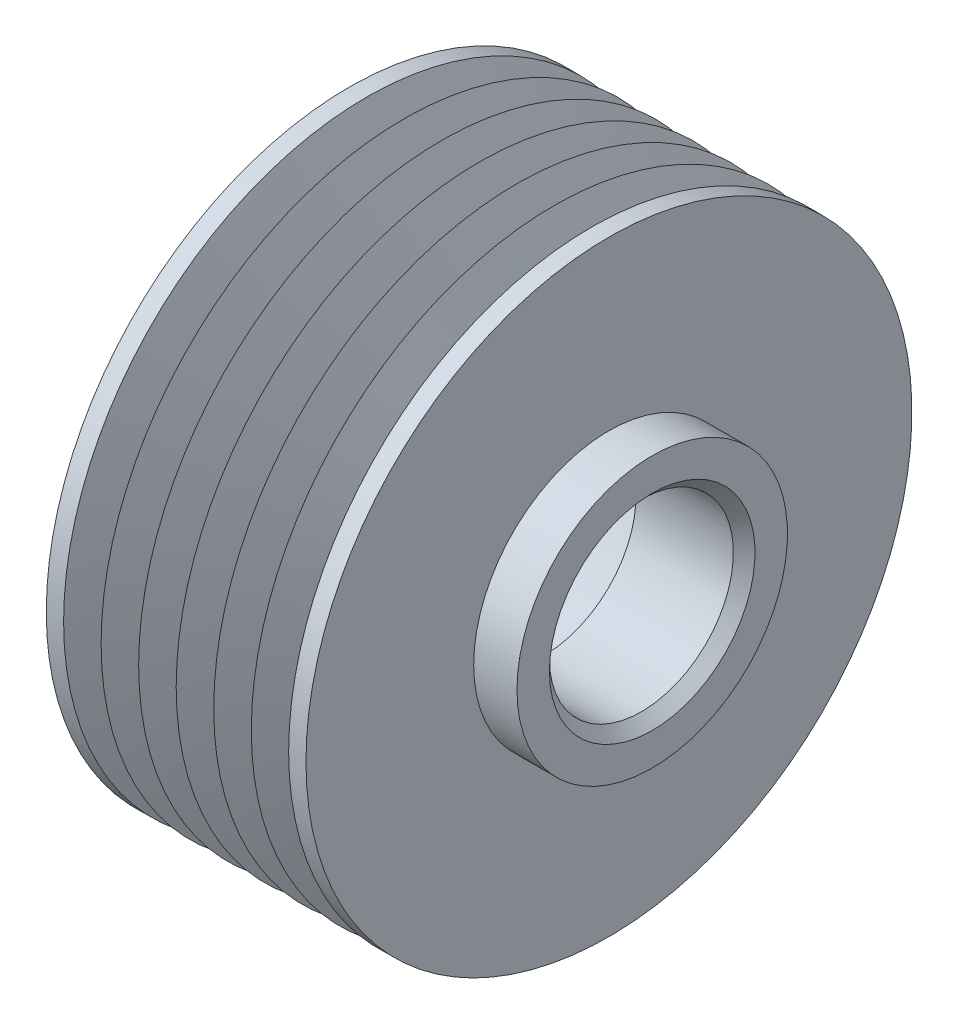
from build123d import *

# Parameters (mm, degrees)
CHANFREIN1_SIZE = 1


with BuildPart() as part:
    # Esquisse1 → Base-R_volution (revolve)
    with BuildSketch(Plane.XY, mode=Mode.PRIVATE) as base_r_volution_sk:
        Polygon((0, 20), (0, 28), (1.6, 28), (3.301127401, 23.5), (5.066666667, 28), (6.771127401, 23.5), (8.536666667, 28), (10.241127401, 23.5), (12.006666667, 28), (13.711127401, 23.5), (15.476666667, 28), (17.181127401, 23.5), (18.946666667, 28), (20.891127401, 23.5), (22.4, 28), (24, 28), (24, 12.5), (28, 12.5), (28, 8.5), (18, 8.5), (18, 15), (15, 18), (2, 18), align=None)
    revolve(base_r_volution_sk.sketch.rotate(Axis((-10, 0, 0), (1, 0, 0)), 90), axis=Axis((-10, 0, 0), (1, 0, 0)))

    # Chanfrein1
    chanfrein1_edges = [part.edges().sort_by_distance(p)[0] for p in [
        (28, 0, -8.5),
    ]]
    chamfer(chanfrein1_edges, length=CHANFREIN1_SIZE)


solid = part.part
